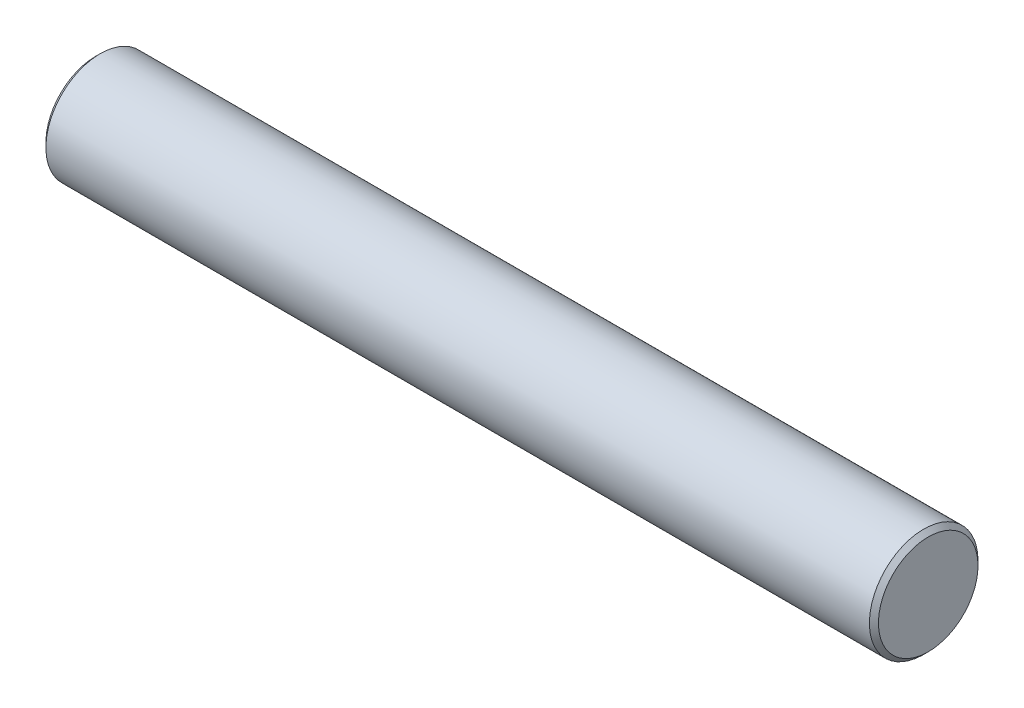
ISO-10303-21;
HEADER;
FILE_DESCRIPTION(('STEP AP214'),'2;1');
FILE_NAME('part.step','',(''),(''),'','','');
FILE_SCHEMA(('AUTOMOTIVE_DESIGN { 1 0 10303 214 1 1 1 1 }'));
ENDSEC;
DATA;
#1=APPLICATION_CONTEXT('core data for automotive mechanical design processes');
#2=APPLICATION_PROTOCOL_DEFINITION('international standard','automotive_design',2000,#1);
#3=PRODUCT_CONTEXT('',#1,'mechanical');
#4=PRODUCT('Part','Part','',(#3));
#5=PRODUCT_RELATED_PRODUCT_CATEGORY('part','',(#4));
#6=PRODUCT_DEFINITION_FORMATION('','',#4);
#7=PRODUCT_DEFINITION_CONTEXT('part definition',#1,'design');
#8=PRODUCT_DEFINITION('design','',#6,#7);
#9=PRODUCT_DEFINITION_SHAPE('','',#8);
#10=(LENGTH_UNIT() NAMED_UNIT(*) SI_UNIT(.MILLI.,.METRE.));
#11=(NAMED_UNIT(*) PLANE_ANGLE_UNIT() SI_UNIT($,.RADIAN.));
#12=(NAMED_UNIT(*) SI_UNIT($,.STERADIAN.) SOLID_ANGLE_UNIT());
#13=UNCERTAINTY_MEASURE_WITH_UNIT(LENGTH_MEASURE(1.E-05),#10,'distance_accuracy_value','');
#14=(GEOMETRIC_REPRESENTATION_CONTEXT(3) GLOBAL_UNCERTAINTY_ASSIGNED_CONTEXT((#13)) GLOBAL_UNIT_ASSIGNED_CONTEXT((#10,
#11,#12)) REPRESENTATION_CONTEXT('',''));
#15=CARTESIAN_POINT('',(0.,0.,0.));
#16=DIRECTION('',(0.,0.,1.));
#17=DIRECTION('',(1.,0.,0.));
#18=AXIS2_PLACEMENT_3D('',#15,#16,#17);
#19=CARTESIAN_POINT('',(46.,0.,0.));
#20=DIRECTION('',(-1.,0.,0.));
#21=DIRECTION('',(0.,0.,1.));
#22=AXIS2_PLACEMENT_3D('',#19,#20,#21);
#23=CYLINDRICAL_SURFACE('',#22,3.);
#24=CARTESIAN_POINT('',(0.25,0.,0.));
#25=DIRECTION('',(1.,0.,0.));
#26=DIRECTION('',(0.,0.,-1.));
#27=AXIS2_PLACEMENT_3D('',#24,#25,#26);
#28=CIRCLE('',#27,3.);
#29=CARTESIAN_POINT('',(0.25,0.,-3.));
#30=VERTEX_POINT('',#29);
#31=EDGE_CURVE('E40',#30,#30,#28,.T.);
#32=ORIENTED_EDGE('',*,*,#31,.T.);
#33=EDGE_LOOP('',(#32));
#34=FACE_BOUND('',#33,.T.);
#35=CARTESIAN_POINT('',(45.75,0.,0.));
#36=DIRECTION('',(1.,0.,0.));
#37=DIRECTION('',(0.,0.,-1.));
#38=AXIS2_PLACEMENT_3D('',#35,#36,#37);
#39=CIRCLE('',#38,3.);
#40=CARTESIAN_POINT('',(45.75,0.,-3.));
#41=VERTEX_POINT('',#40);
#42=EDGE_CURVE('E44',#41,#41,#39,.F.);
#43=ORIENTED_EDGE('',*,*,#42,.T.);
#44=EDGE_LOOP('',(#43));
#45=FACE_BOUND('',#44,.T.);
#46=ADVANCED_FACE('F29',(#34,#45),#23,.T.);
#47=CARTESIAN_POINT('',(46.,0.,0.));
#48=DIRECTION('',(1.,0.,0.));
#49=DIRECTION('',(0.,0.,-1.));
#50=AXIS2_PLACEMENT_3D('',#47,#48,#49);
#51=PLANE('',#50);
#52=CARTESIAN_POINT('',(46.,0.,0.));
#53=DIRECTION('',(1.,0.,0.));
#54=DIRECTION('',(0.,0.,-1.));
#55=AXIS2_PLACEMENT_3D('',#52,#53,#54);
#56=CIRCLE('',#55,2.75);
#57=CARTESIAN_POINT('',(46.,0.,-2.75));
#58=VERTEX_POINT('',#57);
#59=EDGE_CURVE('E10',#58,#58,#56,.T.);
#60=ORIENTED_EDGE('',*,*,#59,.T.);
#61=EDGE_LOOP('',(#60));
#62=FACE_BOUND('',#61,.T.);
#63=ADVANCED_FACE('F60',(#62),#51,.T.);
#64=CARTESIAN_POINT('',(0.,0.,0.));
#65=DIRECTION('',(1.,0.,0.));
#66=DIRECTION('',(0.,0.,-1.));
#67=AXIS2_PLACEMENT_3D('',#64,#65,#66);
#68=PLANE('',#67);
#69=CARTESIAN_POINT('',(0.,0.,0.));
#70=DIRECTION('',(1.,0.,0.));
#71=DIRECTION('',(0.,0.,-1.));
#72=AXIS2_PLACEMENT_3D('',#69,#70,#71);
#73=CIRCLE('',#72,2.75);
#74=CARTESIAN_POINT('',(0.,0.,-2.75));
#75=VERTEX_POINT('',#74);
#76=EDGE_CURVE('E36',#75,#75,#73,.F.);
#77=ORIENTED_EDGE('',*,*,#76,.T.);
#78=EDGE_LOOP('',(#77));
#79=FACE_BOUND('',#78,.T.);
#80=ADVANCED_FACE('F57',(#79),#68,.F.);
#81=CARTESIAN_POINT('',(0.25,0.,0.));
#82=DIRECTION('',(1.,0.,0.));
#83=DIRECTION('',(0.,0.,-1.));
#84=AXIS2_PLACEMENT_3D('',#81,#82,#83);
#85=CONICAL_SURFACE('',#84,3.,0.78539816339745);
#86=ORIENTED_EDGE('',*,*,#76,.F.);
#87=EDGE_LOOP('',(#86));
#88=FACE_BOUND('',#87,.T.);
#89=ORIENTED_EDGE('',*,*,#31,.F.);
#90=EDGE_LOOP('',(#89));
#91=FACE_BOUND('',#90,.T.);
#92=ADVANCED_FACE('F53',(#88,#91),#85,.T.);
#93=CARTESIAN_POINT('',(46.,0.,0.));
#94=DIRECTION('',(-1.,0.,0.));
#95=DIRECTION('',(0.,0.,1.));
#96=AXIS2_PLACEMENT_3D('',#93,#94,#95);
#97=CONICAL_SURFACE('',#96,2.75,0.785398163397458);
#98=ORIENTED_EDGE('',*,*,#42,.F.);
#99=EDGE_LOOP('',(#98));
#100=FACE_BOUND('',#99,.T.);
#101=ORIENTED_EDGE('',*,*,#59,.F.);
#102=EDGE_LOOP('',(#101));
#103=FACE_BOUND('',#102,.T.);
#104=ADVANCED_FACE('F31',(#100,#103),#97,.T.);
#105=CLOSED_SHELL('',(#46,#63,#80,#92,#104));
#106=MANIFOLD_SOLID_BREP('B2',#105);
#107=ADVANCED_BREP_SHAPE_REPRESENTATION('',(#18,#106),#14);
#108=SHAPE_DEFINITION_REPRESENTATION(#9,#107);
ENDSEC;
END-ISO-10303-21;
